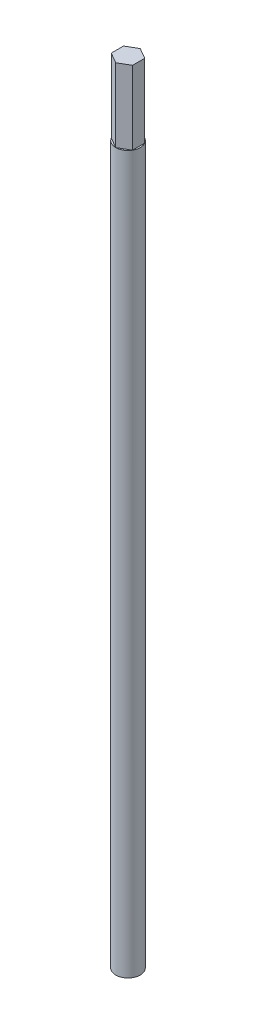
from build123d import *

# Parameters (mm, degrees)
SKETCH1_R           = 1
BOSS_EXTRUDE2_DEPTH = 64.5
SKETCH2_W           = 1
SKETCH2_H           = 1.5
CUT_EXTRUDE2_DEPTH  = 1
CUT_EXTRUDE3_START  = -6
CUT_EXTRUDE3_DEPTH  = 6


with BuildPart() as part:
    # Sketch1 → Boss-Extrude2 (new body)
    with BuildSketch(Plane(origin=(0, 0, 0), x_dir=(1, 0, 0), z_dir=(0, 1, 0))):
        with Locations(Location((0, -1, 0), (0, 0, 270))):
            Circle(SKETCH1_R)
    extrude(amount=BOSS_EXTRUDE2_DEPTH)

    # Sketch2 → Cut-Extrude2 (cut)
    with BuildSketch(Plane.XY):
        with Locations((0, 0.75)):
            Rectangle(SKETCH2_W, SKETCH2_H)
    extrude(amount=CUT_EXTRUDE2_DEPTH, mode=Mode.SUBTRACT)

    # Sketch3 → Cut-Extrude3 (cut)
    with BuildSketch(Plane(origin=(0, 64.5, 0), x_dir=(1, 0, 0), z_dir=(0, 1, 0)).offset(CUT_EXTRUDE3_START)):
        with BuildLine():
            Line((-0.866025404, -0.5), (0, 0))
            ThreePointArc((0, 0), (-0.5, -0.133974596), (-0.866025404, -0.5))
        make_face()
        with BuildLine():
            Line((-0.866025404, -1.5), (-0.866025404, -0.5))
            ThreePointArc((-0.866025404, -0.5), (-1, -1), (-0.866025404, -1.5))
        make_face()
        with BuildLine():
            Line((0, -2), (-0.866025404, -1.5))
            ThreePointArc((-0.866025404, -1.5), (-0.5, -1.866025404), (0, -2))
        make_face()
        with BuildLine():
            ThreePointArc((0, -2), (0.5, -1.866025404), (0.866025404, -1.5))
            Line((0.866025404, -1.5), (0, -2))
        make_face()
        with BuildLine():
            ThreePointArc((1, -1), (0.965925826, -0.741180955), (0.866025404, -0.5))
            Line((0.866025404, -0.5), (0.866025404, -1.5))
            ThreePointArc((0.866025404, -1.5), (0.965925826, -1.258819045), (1, -1))
        make_face()
        with BuildLine():
            ThreePointArc((0.866025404, -0.5), (0.5, -0.133974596), (0, 0))
            Line((0, 0), (0.866025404, -0.5))
        make_face()
    extrude(amount=CUT_EXTRUDE3_DEPTH, mode=Mode.SUBTRACT)


solid = part.part
